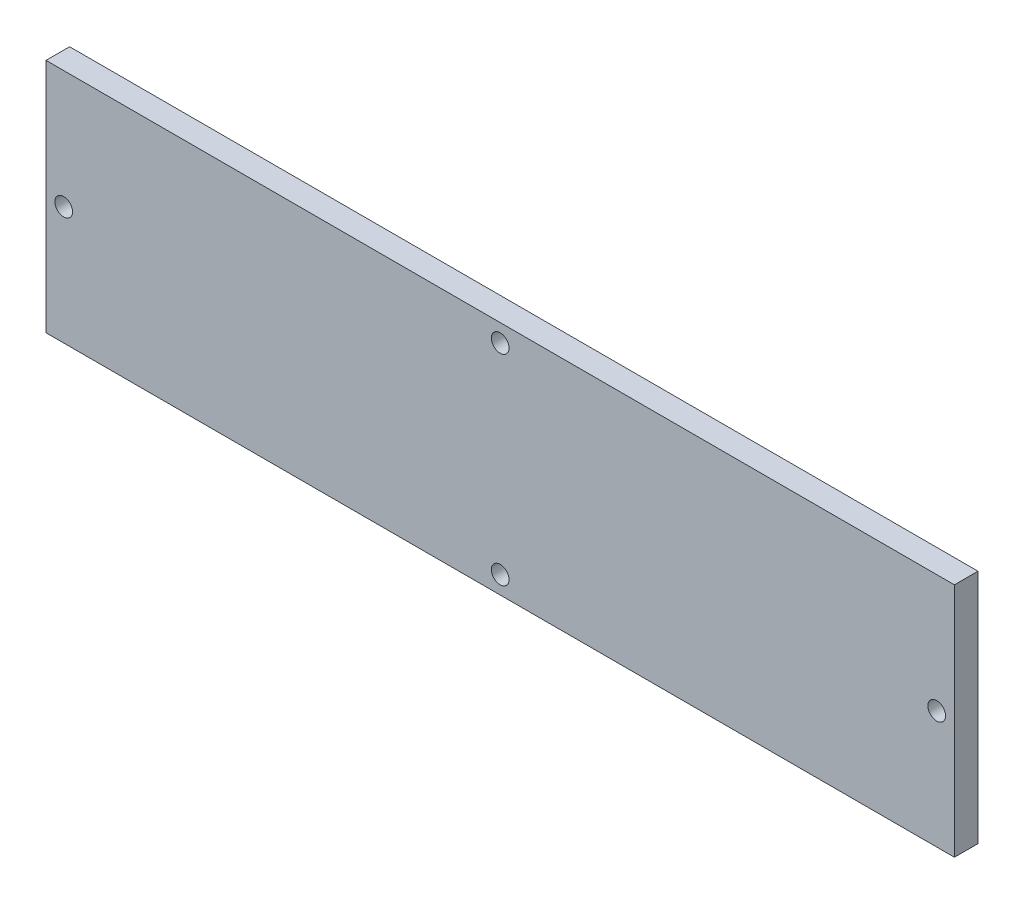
ISO-10303-21;
HEADER;
FILE_DESCRIPTION(('STEP AP214'),'2;1');
FILE_NAME('part.step','',(''),(''),'','','');
FILE_SCHEMA(('AUTOMOTIVE_DESIGN { 1 0 10303 214 1 1 1 1 }'));
ENDSEC;
DATA;
#1=APPLICATION_CONTEXT('core data for automotive mechanical design processes');
#2=APPLICATION_PROTOCOL_DEFINITION('international standard','automotive_design',2000,#1);
#3=PRODUCT_CONTEXT('',#1,'mechanical');
#4=PRODUCT('Part','Part','',(#3));
#5=PRODUCT_RELATED_PRODUCT_CATEGORY('part','',(#4));
#6=PRODUCT_DEFINITION_FORMATION('','',#4);
#7=PRODUCT_DEFINITION_CONTEXT('part definition',#1,'design');
#8=PRODUCT_DEFINITION('design','',#6,#7);
#9=PRODUCT_DEFINITION_SHAPE('','',#8);
#10=(LENGTH_UNIT() NAMED_UNIT(*) SI_UNIT(.MILLI.,.METRE.));
#11=(NAMED_UNIT(*) PLANE_ANGLE_UNIT() SI_UNIT($,.RADIAN.));
#12=(NAMED_UNIT(*) SI_UNIT($,.STERADIAN.) SOLID_ANGLE_UNIT());
#13=UNCERTAINTY_MEASURE_WITH_UNIT(LENGTH_MEASURE(1.E-05),#10,'distance_accuracy_value','');
#14=(GEOMETRIC_REPRESENTATION_CONTEXT(3) GLOBAL_UNCERTAINTY_ASSIGNED_CONTEXT((#13)) GLOBAL_UNIT_ASSIGNED_CONTEXT((#10,
#11,#12)) REPRESENTATION_CONTEXT('',''));
#15=CARTESIAN_POINT('',(0.,0.,0.));
#16=DIRECTION('',(0.,0.,1.));
#17=DIRECTION('',(1.,0.,0.));
#18=AXIS2_PLACEMENT_3D('',#15,#16,#17);
#19=CARTESIAN_POINT('',(-63.167472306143,31.0913393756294,6.));
#20=DIRECTION('',(1.,0.,0.));
#21=DIRECTION('',(0.,0.,-1.));
#22=AXIS2_PLACEMENT_3D('',#19,#20,#21);
#23=PLANE('',#22);
#24=DIRECTION('',(0.,1.,0.));
#25=VECTOR('',#24,1.);
#26=CARTESIAN_POINT('',(-63.167472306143,31.0913393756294,2.));
#27=LINE('',#26,#25);
#28=CARTESIAN_POINT('',(-63.167472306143,-8.9086606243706,2.));
#29=VERTEX_POINT('',#28);
#30=CARTESIAN_POINT('',(-63.167472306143,31.0913393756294,2.));
#31=VERTEX_POINT('',#30);
#32=EDGE_CURVE('E46',#29,#31,#27,.T.);
#33=ORIENTED_EDGE('',*,*,#32,.F.);
#34=DIRECTION('',(0.,0.,-1.));
#35=VECTOR('',#34,1.);
#36=CARTESIAN_POINT('',(-63.167472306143,-8.9086606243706,6.));
#37=LINE('',#36,#35);
#38=CARTESIAN_POINT('',(-63.167472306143,-8.9086606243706,6.));
#39=VERTEX_POINT('',#38);
#40=EDGE_CURVE('E11',#39,#29,#37,.T.);
#41=ORIENTED_EDGE('',*,*,#40,.F.);
#42=DIRECTION('',(0.,-1.,0.));
#43=VECTOR('',#42,1.);
#44=CARTESIAN_POINT('',(-63.167472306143,31.0913393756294,6.));
#45=LINE('',#44,#43);
#46=CARTESIAN_POINT('',(-63.167472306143,31.0913393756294,6.));
#47=VERTEX_POINT('',#46);
#48=EDGE_CURVE('E141',#47,#39,#45,.T.);
#49=ORIENTED_EDGE('',*,*,#48,.F.);
#50=DIRECTION('',(0.,0.,-1.));
#51=VECTOR('',#50,1.);
#52=CARTESIAN_POINT('',(-63.167472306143,31.0913393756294,6.));
#53=LINE('',#52,#51);
#54=EDGE_CURVE('E150',#47,#31,#53,.T.);
#55=ORIENTED_EDGE('',*,*,#54,.T.);
#56=EDGE_LOOP('',(#33,#41,#49,#55));
#57=FACE_BOUND('',#56,.T.);
#58=ADVANCED_FACE('F32',(#57),#23,.F.);
#59=CARTESIAN_POINT('',(-63.167472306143,-8.9086606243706,6.));
#60=DIRECTION('',(0.,1.,0.));
#61=DIRECTION('',(0.,0.,1.));
#62=AXIS2_PLACEMENT_3D('',#59,#60,#61);
#63=PLANE('',#62);
#64=DIRECTION('',(-1.,0.,0.));
#65=VECTOR('',#64,1.);
#66=CARTESIAN_POINT('',(90.832527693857,-8.9086606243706,2.));
#67=LINE('',#66,#65);
#68=CARTESIAN_POINT('',(90.832527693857,-8.9086606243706,2.));
#69=VERTEX_POINT('',#68);
#70=EDGE_CURVE('E136',#69,#29,#67,.T.);
#71=ORIENTED_EDGE('',*,*,#70,.F.);
#72=DIRECTION('',(0.,0.,-1.));
#73=VECTOR('',#72,1.);
#74=CARTESIAN_POINT('',(90.832527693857,-8.9086606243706,6.));
#75=LINE('',#74,#73);
#76=CARTESIAN_POINT('',(90.832527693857,-8.9086606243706,6.));
#77=VERTEX_POINT('',#76);
#78=EDGE_CURVE('E39',#77,#69,#75,.T.);
#79=ORIENTED_EDGE('',*,*,#78,.F.);
#80=DIRECTION('',(1.,0.,0.));
#81=VECTOR('',#80,1.);
#82=CARTESIAN_POINT('',(-63.167472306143,-8.9086606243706,6.));
#83=LINE('',#82,#81);
#84=EDGE_CURVE('E144',#39,#77,#83,.T.);
#85=ORIENTED_EDGE('',*,*,#84,.F.);
#86=ORIENTED_EDGE('',*,*,#40,.T.);
#87=EDGE_LOOP('',(#71,#79,#85,#86));
#88=FACE_BOUND('',#87,.T.);
#89=ADVANCED_FACE('F164',(#88),#63,.F.);
#90=CARTESIAN_POINT('',(90.832527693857,31.0913393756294,6.));
#91=DIRECTION('',(-1.,0.,0.));
#92=DIRECTION('',(0.,0.,1.));
#93=AXIS2_PLACEMENT_3D('',#90,#91,#92);
#94=PLANE('',#93);
#95=DIRECTION('',(0.,-1.,0.));
#96=VECTOR('',#95,1.);
#97=CARTESIAN_POINT('',(90.832527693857,31.0913393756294,2.));
#98=LINE('',#97,#96);
#99=CARTESIAN_POINT('',(90.832527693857,31.0913393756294,2.));
#100=VERTEX_POINT('',#99);
#101=EDGE_CURVE('E131',#100,#69,#98,.T.);
#102=ORIENTED_EDGE('',*,*,#101,.F.);
#103=DIRECTION('',(0.,0.,-1.));
#104=VECTOR('',#103,1.);
#105=CARTESIAN_POINT('',(90.832527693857,31.0913393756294,6.));
#106=LINE('',#105,#104);
#107=CARTESIAN_POINT('',(90.832527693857,31.0913393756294,6.));
#108=VERTEX_POINT('',#107);
#109=EDGE_CURVE('E153',#108,#100,#106,.T.);
#110=ORIENTED_EDGE('',*,*,#109,.F.);
#111=DIRECTION('',(0.,1.,0.));
#112=VECTOR('',#111,1.);
#113=CARTESIAN_POINT('',(90.832527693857,31.0913393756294,6.));
#114=LINE('',#113,#112);
#115=EDGE_CURVE('E146',#77,#108,#114,.T.);
#116=ORIENTED_EDGE('',*,*,#115,.F.);
#117=ORIENTED_EDGE('',*,*,#78,.T.);
#118=EDGE_LOOP('',(#102,#110,#116,#117));
#119=FACE_BOUND('',#118,.T.);
#120=ADVANCED_FACE('F160',(#119),#94,.F.);
#121=CARTESIAN_POINT('',(-63.167472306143,31.0913393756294,6.));
#122=DIRECTION('',(0.,-1.,0.));
#123=DIRECTION('',(0.,0.,-1.));
#124=AXIS2_PLACEMENT_3D('',#121,#122,#123);
#125=PLANE('',#124);
#126=DIRECTION('',(1.,0.,0.));
#127=VECTOR('',#126,1.);
#128=CARTESIAN_POINT('',(90.832527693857,31.0913393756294,2.));
#129=LINE('',#128,#127);
#130=EDGE_CURVE('E139',#31,#100,#129,.T.);
#131=ORIENTED_EDGE('',*,*,#130,.F.);
#132=ORIENTED_EDGE('',*,*,#54,.F.);
#133=DIRECTION('',(-1.,0.,0.));
#134=VECTOR('',#133,1.);
#135=CARTESIAN_POINT('',(-63.167472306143,31.0913393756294,6.));
#136=LINE('',#135,#134);
#137=EDGE_CURVE('E148',#108,#47,#136,.T.);
#138=ORIENTED_EDGE('',*,*,#137,.F.);
#139=ORIENTED_EDGE('',*,*,#109,.T.);
#140=EDGE_LOOP('',(#131,#132,#138,#139));
#141=FACE_BOUND('',#140,.T.);
#142=ADVANCED_FACE('F172',(#141),#125,.F.);
#143=CARTESIAN_POINT('',(-63.167472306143,-8.9086606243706,6.));
#144=DIRECTION('',(0.,0.,1.));
#145=DIRECTION('',(1.,0.,0.));
#146=AXIS2_PLACEMENT_3D('',#143,#144,#145);
#147=PLANE('',#146);
#148=CARTESIAN_POINT('',(-60.167472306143,11.0913393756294,6.));
#149=DIRECTION('',(0.,0.,1.));
#150=DIRECTION('',(1.,0.,0.));
#151=AXIS2_PLACEMENT_3D('',#148,#149,#150);
#152=CIRCLE('',#151,1.5);
#153=CARTESIAN_POINT('',(-58.667472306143,11.0913393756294,6.));
#154=VERTEX_POINT('',#153);
#155=EDGE_CURVE('E305',#154,#154,#152,.T.);
#156=ORIENTED_EDGE('',*,*,#155,.F.);
#157=EDGE_LOOP('',(#156));
#158=FACE_BOUND('',#157,.T.);
#159=CARTESIAN_POINT('',(13.832527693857,28.0913393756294,6.));
#160=DIRECTION('',(0.,0.,1.));
#161=DIRECTION('',(1.,0.,0.));
#162=AXIS2_PLACEMENT_3D('',#159,#160,#161);
#163=CIRCLE('',#162,1.5);
#164=CARTESIAN_POINT('',(15.332527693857,28.0913393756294,6.));
#165=VERTEX_POINT('',#164);
#166=EDGE_CURVE('E307',#165,#165,#163,.T.);
#167=ORIENTED_EDGE('',*,*,#166,.F.);
#168=EDGE_LOOP('',(#167));
#169=FACE_BOUND('',#168,.T.);
#170=CARTESIAN_POINT('',(87.832527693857,11.0913393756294,6.));
#171=DIRECTION('',(0.,0.,1.));
#172=DIRECTION('',(1.,0.,0.));
#173=AXIS2_PLACEMENT_3D('',#170,#171,#172);
#174=CIRCLE('',#173,1.5);
#175=CARTESIAN_POINT('',(89.332527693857,11.0913393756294,6.));
#176=VERTEX_POINT('',#175);
#177=EDGE_CURVE('E315',#176,#176,#174,.T.);
#178=ORIENTED_EDGE('',*,*,#177,.F.);
#179=EDGE_LOOP('',(#178));
#180=FACE_BOUND('',#179,.T.);
#181=CARTESIAN_POINT('',(13.832527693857,-5.9086606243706,6.));
#182=DIRECTION('',(0.,0.,1.));
#183=DIRECTION('',(1.,0.,0.));
#184=AXIS2_PLACEMENT_3D('',#181,#182,#183);
#185=CIRCLE('',#184,1.5);
#186=CARTESIAN_POINT('',(15.332527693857,-5.9086606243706,6.));
#187=VERTEX_POINT('',#186);
#188=EDGE_CURVE('E321',#187,#187,#185,.T.);
#189=ORIENTED_EDGE('',*,*,#188,.F.);
#190=EDGE_LOOP('',(#189));
#191=FACE_BOUND('',#190,.T.);
#192=ORIENTED_EDGE('',*,*,#48,.T.);
#193=ORIENTED_EDGE('',*,*,#84,.T.);
#194=ORIENTED_EDGE('',*,*,#115,.T.);
#195=ORIENTED_EDGE('',*,*,#137,.T.);
#196=EDGE_LOOP('',(#192,#193,#194,#195));
#197=FACE_BOUND('',#196,.T.);
#198=ADVANCED_FACE('F174',(#158,#169,#180,#191,#197),#147,.T.);
#199=CARTESIAN_POINT('',(90.832527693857,-8.9086606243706,2.));
#200=DIRECTION('',(0.,0.,-1.));
#201=DIRECTION('',(-1.,0.,0.));
#202=AXIS2_PLACEMENT_3D('',#199,#200,#201);
#203=PLANE('',#202);
#204=CARTESIAN_POINT('',(-60.167472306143,11.0913393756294,2.));
#205=DIRECTION('',(0.,0.,1.));
#206=DIRECTION('',(1.,0.,0.));
#207=AXIS2_PLACEMENT_3D('',#204,#205,#206);
#208=CIRCLE('',#207,1.5);
#209=CARTESIAN_POINT('',(-58.667472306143,11.0913393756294,2.));
#210=VERTEX_POINT('',#209);
#211=EDGE_CURVE('E303',#210,#210,#208,.T.);
#212=ORIENTED_EDGE('',*,*,#211,.T.);
#213=EDGE_LOOP('',(#212));
#214=FACE_BOUND('',#213,.T.);
#215=CARTESIAN_POINT('',(13.832527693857,28.0913393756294,2.));
#216=DIRECTION('',(0.,0.,1.));
#217=DIRECTION('',(1.,0.,0.));
#218=AXIS2_PLACEMENT_3D('',#215,#216,#217);
#219=CIRCLE('',#218,1.5);
#220=CARTESIAN_POINT('',(15.332527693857,28.0913393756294,2.));
#221=VERTEX_POINT('',#220);
#222=EDGE_CURVE('E312',#221,#221,#219,.T.);
#223=ORIENTED_EDGE('',*,*,#222,.T.);
#224=EDGE_LOOP('',(#223));
#225=FACE_BOUND('',#224,.T.);
#226=CARTESIAN_POINT('',(87.832527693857,11.0913393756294,2.));
#227=DIRECTION('',(0.,0.,1.));
#228=DIRECTION('',(1.,0.,0.));
#229=AXIS2_PLACEMENT_3D('',#226,#227,#228);
#230=CIRCLE('',#229,1.5);
#231=CARTESIAN_POINT('',(89.332527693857,11.0913393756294,2.));
#232=VERTEX_POINT('',#231);
#233=EDGE_CURVE('E318',#232,#232,#230,.T.);
#234=ORIENTED_EDGE('',*,*,#233,.T.);
#235=EDGE_LOOP('',(#234));
#236=FACE_BOUND('',#235,.T.);
#237=CARTESIAN_POINT('',(13.832527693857,-5.9086606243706,2.));
#238=DIRECTION('',(0.,0.,1.));
#239=DIRECTION('',(1.,0.,0.));
#240=AXIS2_PLACEMENT_3D('',#237,#238,#239);
#241=CIRCLE('',#240,1.5);
#242=CARTESIAN_POINT('',(15.332527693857,-5.9086606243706,2.));
#243=VERTEX_POINT('',#242);
#244=EDGE_CURVE('E324',#243,#243,#241,.T.);
#245=ORIENTED_EDGE('',*,*,#244,.T.);
#246=EDGE_LOOP('',(#245));
#247=FACE_BOUND('',#246,.T.);
#248=DIRECTION('',(1.,0.,0.));
#249=VECTOR('',#248,1.);
#250=CARTESIAN_POINT('',(84.832527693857,25.0913393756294,2.));
#251=LINE('',#250,#249);
#252=CARTESIAN_POINT('',(-57.167472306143,25.0913393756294,2.));
#253=VERTEX_POINT('',#252);
#254=CARTESIAN_POINT('',(84.832527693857,25.0913393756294,2.));
#255=VERTEX_POINT('',#254);
#256=EDGE_CURVE('E128',#253,#255,#251,.T.);
#257=ORIENTED_EDGE('',*,*,#256,.F.);
#258=DIRECTION('',(0.,1.,0.));
#259=VECTOR('',#258,1.);
#260=CARTESIAN_POINT('',(-57.167472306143,25.0913393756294,2.));
#261=LINE('',#260,#259);
#262=CARTESIAN_POINT('',(-57.167472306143,-2.9086606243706,2.));
#263=VERTEX_POINT('',#262);
#264=EDGE_CURVE('E98',#263,#253,#261,.T.);
#265=ORIENTED_EDGE('',*,*,#264,.F.);
#266=DIRECTION('',(-1.,0.,0.));
#267=VECTOR('',#266,1.);
#268=CARTESIAN_POINT('',(84.832527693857,-2.9086606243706,2.));
#269=LINE('',#268,#267);
#270=CARTESIAN_POINT('',(84.832527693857,-2.9086606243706,2.));
#271=VERTEX_POINT('',#270);
#272=EDGE_CURVE('E124',#271,#263,#269,.T.);
#273=ORIENTED_EDGE('',*,*,#272,.F.);
#274=DIRECTION('',(0.,-1.,0.));
#275=VECTOR('',#274,1.);
#276=CARTESIAN_POINT('',(84.832527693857,25.0913393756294,2.));
#277=LINE('',#276,#275);
#278=EDGE_CURVE('E111',#255,#271,#277,.T.);
#279=ORIENTED_EDGE('',*,*,#278,.F.);
#280=EDGE_LOOP('',(#257,#265,#273,#279));
#281=FACE_BOUND('',#280,.T.);
#282=ORIENTED_EDGE('',*,*,#101,.T.);
#283=ORIENTED_EDGE('',*,*,#70,.T.);
#284=ORIENTED_EDGE('',*,*,#32,.T.);
#285=ORIENTED_EDGE('',*,*,#130,.T.);
#286=EDGE_LOOP('',(#282,#283,#284,#285));
#287=FACE_BOUND('',#286,.T.);
#288=ADVANCED_FACE('F166',(#214,#225,#236,#247,#281,#287),#203,.T.);
#289=CARTESIAN_POINT('',(84.832527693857,25.0913393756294,2.));
#290=DIRECTION('',(1.,0.,0.));
#291=DIRECTION('',(0.,0.,-1.));
#292=AXIS2_PLACEMENT_3D('',#289,#290,#291);
#293=PLANE('',#292);
#294=DIRECTION('',(0.,-1.,0.));
#295=VECTOR('',#294,1.);
#296=CARTESIAN_POINT('',(84.832527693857,25.0913393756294,0.));
#297=LINE('',#296,#295);
#298=CARTESIAN_POINT('',(84.832527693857,25.0913393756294,0.));
#299=VERTEX_POINT('',#298);
#300=CARTESIAN_POINT('',(84.832527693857,-2.9086606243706,0.));
#301=VERTEX_POINT('',#300);
#302=EDGE_CURVE('E118',#299,#301,#297,.T.);
#303=ORIENTED_EDGE('',*,*,#302,.F.);
#304=DIRECTION('',(0.,0.,-1.));
#305=VECTOR('',#304,1.);
#306=CARTESIAN_POINT('',(84.832527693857,25.0913393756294,2.));
#307=LINE('',#306,#305);
#308=EDGE_CURVE('E102',#255,#299,#307,.T.);
#309=ORIENTED_EDGE('',*,*,#308,.F.);
#310=ORIENTED_EDGE('',*,*,#278,.T.);
#311=DIRECTION('',(0.,0.,-1.));
#312=VECTOR('',#311,1.);
#313=CARTESIAN_POINT('',(84.832527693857,-2.9086606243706,2.));
#314=LINE('',#313,#312);
#315=EDGE_CURVE('E130',#271,#301,#314,.T.);
#316=ORIENTED_EDGE('',*,*,#315,.T.);
#317=EDGE_LOOP('',(#303,#309,#310,#316));
#318=FACE_BOUND('',#317,.T.);
#319=ADVANCED_FACE('F182',(#318),#293,.T.);
#320=CARTESIAN_POINT('',(84.832527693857,25.0913393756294,2.));
#321=DIRECTION('',(0.,1.,0.));
#322=DIRECTION('',(0.,0.,1.));
#323=AXIS2_PLACEMENT_3D('',#320,#321,#322);
#324=PLANE('',#323);
#325=DIRECTION('',(1.,0.,0.));
#326=VECTOR('',#325,1.);
#327=CARTESIAN_POINT('',(84.832527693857,25.0913393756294,0.));
#328=LINE('',#327,#326);
#329=CARTESIAN_POINT('',(-57.167472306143,25.0913393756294,0.));
#330=VERTEX_POINT('',#329);
#331=EDGE_CURVE('E106',#330,#299,#328,.T.);
#332=ORIENTED_EDGE('',*,*,#331,.F.);
#333=DIRECTION('',(0.,0.,-1.));
#334=VECTOR('',#333,1.);
#335=CARTESIAN_POINT('',(-57.167472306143,25.0913393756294,2.));
#336=LINE('',#335,#334);
#337=EDGE_CURVE('E95',#253,#330,#336,.T.);
#338=ORIENTED_EDGE('',*,*,#337,.F.);
#339=ORIENTED_EDGE('',*,*,#256,.T.);
#340=ORIENTED_EDGE('',*,*,#308,.T.);
#341=EDGE_LOOP('',(#332,#338,#339,#340));
#342=FACE_BOUND('',#341,.T.);
#343=ADVANCED_FACE('F107',(#342),#324,.T.);
#344=CARTESIAN_POINT('',(-57.167472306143,25.0913393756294,2.));
#345=DIRECTION('',(-1.,0.,0.));
#346=DIRECTION('',(0.,0.,1.));
#347=AXIS2_PLACEMENT_3D('',#344,#345,#346);
#348=PLANE('',#347);
#349=DIRECTION('',(0.,1.,0.));
#350=VECTOR('',#349,1.);
#351=CARTESIAN_POINT('',(-57.167472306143,25.0913393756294,0.));
#352=LINE('',#351,#350);
#353=CARTESIAN_POINT('',(-57.167472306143,-2.9086606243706,0.));
#354=VERTEX_POINT('',#353);
#355=EDGE_CURVE('E54',#354,#330,#352,.T.);
#356=ORIENTED_EDGE('',*,*,#355,.F.);
#357=DIRECTION('',(0.,0.,-1.));
#358=VECTOR('',#357,1.);
#359=CARTESIAN_POINT('',(-57.167472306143,-2.9086606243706,2.));
#360=LINE('',#359,#358);
#361=EDGE_CURVE('E103',#263,#354,#360,.T.);
#362=ORIENTED_EDGE('',*,*,#361,.F.);
#363=ORIENTED_EDGE('',*,*,#264,.T.);
#364=ORIENTED_EDGE('',*,*,#337,.T.);
#365=EDGE_LOOP('',(#356,#362,#363,#364));
#366=FACE_BOUND('',#365,.T.);
#367=ADVANCED_FACE('F97',(#366),#348,.T.);
#368=CARTESIAN_POINT('',(84.832527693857,-2.9086606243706,2.));
#369=DIRECTION('',(0.,-1.,0.));
#370=DIRECTION('',(0.,0.,-1.));
#371=AXIS2_PLACEMENT_3D('',#368,#369,#370);
#372=PLANE('',#371);
#373=DIRECTION('',(-1.,0.,0.));
#374=VECTOR('',#373,1.);
#375=CARTESIAN_POINT('',(84.832527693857,-2.9086606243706,0.));
#376=LINE('',#375,#374);
#377=EDGE_CURVE('E116',#301,#354,#376,.T.);
#378=ORIENTED_EDGE('',*,*,#377,.F.);
#379=ORIENTED_EDGE('',*,*,#315,.F.);
#380=ORIENTED_EDGE('',*,*,#272,.T.);
#381=ORIENTED_EDGE('',*,*,#361,.T.);
#382=EDGE_LOOP('',(#378,#379,#380,#381));
#383=FACE_BOUND('',#382,.T.);
#384=ADVANCED_FACE('F231',(#383),#372,.T.);
#385=CARTESIAN_POINT('',(-63.167472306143,-8.9086606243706,0.));
#386=DIRECTION('',(0.,0.,1.));
#387=DIRECTION('',(1.,0.,0.));
#388=AXIS2_PLACEMENT_3D('',#385,#386,#387);
#389=PLANE('',#388);
#390=ORIENTED_EDGE('',*,*,#302,.T.);
#391=ORIENTED_EDGE('',*,*,#377,.T.);
#392=ORIENTED_EDGE('',*,*,#355,.T.);
#393=ORIENTED_EDGE('',*,*,#331,.T.);
#394=EDGE_LOOP('',(#390,#391,#392,#393));
#395=FACE_BOUND('',#394,.T.);
#396=ADVANCED_FACE('F114',(#395),#389,.F.);
#397=CARTESIAN_POINT('',(13.832527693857,-5.9086606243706,2.));
#398=DIRECTION('',(0.,0.,1.));
#399=DIRECTION('',(1.,0.,0.));
#400=AXIS2_PLACEMENT_3D('',#397,#398,#399);
#401=CYLINDRICAL_SURFACE('',#400,1.5);
#402=ORIENTED_EDGE('',*,*,#244,.F.);
#403=EDGE_LOOP('',(#402));
#404=FACE_BOUND('',#403,.T.);
#405=ORIENTED_EDGE('',*,*,#188,.T.);
#406=EDGE_LOOP('',(#405));
#407=FACE_BOUND('',#406,.T.);
#408=ADVANCED_FACE('F248',(#404,#407),#401,.F.);
#409=CARTESIAN_POINT('',(87.832527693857,11.0913393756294,2.));
#410=DIRECTION('',(0.,0.,1.));
#411=DIRECTION('',(1.,0.,0.));
#412=AXIS2_PLACEMENT_3D('',#409,#410,#411);
#413=CYLINDRICAL_SURFACE('',#412,1.5);
#414=ORIENTED_EDGE('',*,*,#233,.F.);
#415=EDGE_LOOP('',(#414));
#416=FACE_BOUND('',#415,.T.);
#417=ORIENTED_EDGE('',*,*,#177,.T.);
#418=EDGE_LOOP('',(#417));
#419=FACE_BOUND('',#418,.T.);
#420=ADVANCED_FACE('F266',(#416,#419),#413,.F.);
#421=CARTESIAN_POINT('',(13.832527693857,28.0913393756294,2.));
#422=DIRECTION('',(0.,0.,1.));
#423=DIRECTION('',(1.,0.,0.));
#424=AXIS2_PLACEMENT_3D('',#421,#422,#423);
#425=CYLINDRICAL_SURFACE('',#424,1.5);
#426=ORIENTED_EDGE('',*,*,#222,.F.);
#427=EDGE_LOOP('',(#426));
#428=FACE_BOUND('',#427,.T.);
#429=ORIENTED_EDGE('',*,*,#166,.T.);
#430=EDGE_LOOP('',(#429));
#431=FACE_BOUND('',#430,.T.);
#432=ADVANCED_FACE('F276',(#428,#431),#425,.F.);
#433=CARTESIAN_POINT('',(-60.167472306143,11.0913393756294,2.));
#434=DIRECTION('',(0.,0.,1.));
#435=DIRECTION('',(1.,0.,0.));
#436=AXIS2_PLACEMENT_3D('',#433,#434,#435);
#437=CYLINDRICAL_SURFACE('',#436,1.5);
#438=ORIENTED_EDGE('',*,*,#211,.F.);
#439=EDGE_LOOP('',(#438));
#440=FACE_BOUND('',#439,.T.);
#441=ORIENTED_EDGE('',*,*,#155,.T.);
#442=EDGE_LOOP('',(#441));
#443=FACE_BOUND('',#442,.T.);
#444=ADVANCED_FACE('F286',(#440,#443),#437,.F.);
#445=CLOSED_SHELL('',(#58,#89,#120,#142,#198,#288,#319,#343,#367,#384,#396,#408,#420,#432,#444));
#446=MANIFOLD_SOLID_BREP('B2',#445);
#447=ADVANCED_BREP_SHAPE_REPRESENTATION('',(#18,#446),#14);
#448=SHAPE_DEFINITION_REPRESENTATION(#9,#447);
ENDSEC;
END-ISO-10303-21;
